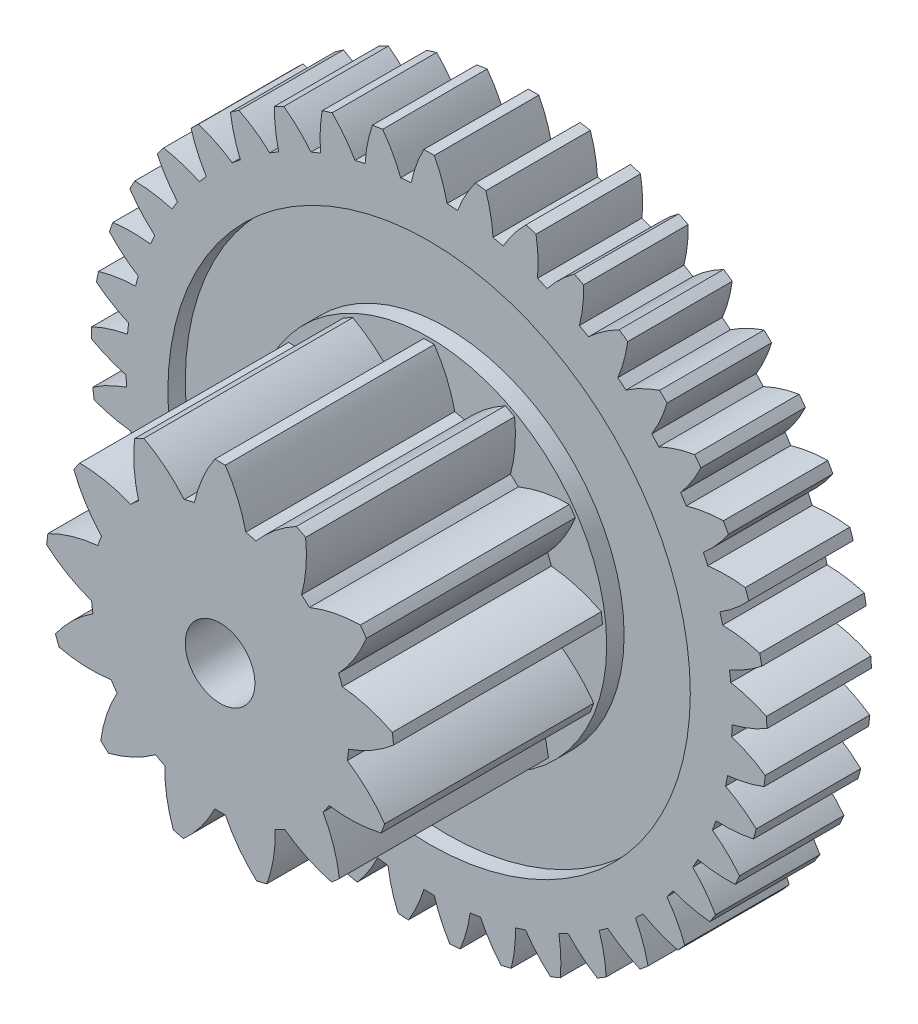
from build123d import *

# Parameters (mm, degrees)
ESQUISSE1_R                  = 9.7
BASE_EXTRUSION_DEPTH         = 3
ESQUISSE2_R                  = 5
BOSS_EXTRU_1_DEPTH           = 6
ENL_V_START                  = -6
ENL_V_MAT_EXTRU_1_DEPTH      = 6
R_P_TITION_CIRCULAIRE1_COUNT = 13
ENL_V_MAT_EXTRU_2_DEPTH      = 15.972641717
R_P_TITION_CIRCULAIRE2_COUNT = 41
ESQUISSE5_R                  = 1
ENL_V_MAT_EXTRU_3_DEPTH      = 17.405209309
ESQUISSE6_R                  = 2.25
ESQUISSE6_R_2                = 1
EXTRUSION1_DEPTH             = 0.5
ESQUISSE7_R                  = 7.5
ESQUISSE7_R_2                = 5.1
ENL_V_MAT_EXTRU_4_DEPTH      = 0.5


with BuildPart() as part:
    # Esquisse1 → Base-Extrusion (new body)
    with BuildSketch(Plane.XY):
        Circle(ESQUISSE1_R)
    extrude(amount=BASE_EXTRUSION_DEPTH)

    # Esquisse2 → Boss.-Extru.1 (add)
    with BuildSketch(Plane.XY.offset(3)):
        Circle(ESQUISSE2_R)
    extrude(amount=BOSS_EXTRU_1_DEPTH)

    # Esquisse3 → Enl_v. mat.-Extru.1 (cut)
    with BuildSketch(Plane.XY.offset(9).offset(ENL_V_START)):
        with BuildLine():
            Line((0.885467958, 3.592484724), (1.326867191, 5.383311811))
            Line((1.326867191, 5.383311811), (-1.326867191, 5.383311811))
            Line((-1.326867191, 5.383311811), (-0.885467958, 3.592484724))
            ThreePointArc((-0.885467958, 3.592484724), (-0.811650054, 3.609878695), (-0.737491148, 3.625756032))
            ThreePointArc((-0.737491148, 3.625756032), (-0.508302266, 4.339396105), (-0.15, 4.997749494))
            ThreePointArc((-0.15, 4.997749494), (0, 5), (0.15, 4.997749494))
            ThreePointArc((0.15, 4.997749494), (0.508302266, 4.339396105), (0.737491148, 3.625756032))
            ThreePointArc((0.737491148, 3.625756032), (0.811650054, 3.609878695), (0.885467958, 3.592484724))
        make_face()
    enl_v_mat_extru_1 = extrude(amount=ENL_V_MAT_EXTRU_1_DEPTH, mode=Mode.SUBTRACT)

    # R_p_tition circulaire1: Enl_v. mat.-Extru.1 ×13 about axis
    r_p_tition_circulaire1_axis = Axis((0, 0, 0), (0, 0, 1))
    for i in range(1, R_P_TITION_CIRCULAIRE1_COUNT):
        add(enl_v_mat_extru_1.rotate(r_p_tition_circulaire1_axis, i * 360 / R_P_TITION_CIRCULAIRE1_COUNT), mode=Mode.SUBTRACT)

    # Esquisse4 → Enl_v. mat.-Extru.2 (cut, through all)
    with BuildSketch(Plane.XY.offset(3)):
        with BuildLine():
            Line((0.6659785, 8.67447247), (1.057291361, 13.771382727))
            Line((1.057291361, 13.771382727), (-1.057291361, 13.771382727))
            Line((-1.057291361, 13.771382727), (-0.6659785, 8.67447247))
            ThreePointArc((-0.6659785, 8.67447247), (-0.591171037, 8.67989152), (-0.516319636, 8.684665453))
            ThreePointArc((-0.516319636, 8.684665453), (-0.367491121, 9.204153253), (-0.15, 9.698840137))
            ThreePointArc((-0.15, 9.698840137), (0, 9.7), (0.15, 9.698840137))
            ThreePointArc((0.15, 9.698840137), (0.367491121, 9.204153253), (0.516319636, 8.684665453))
            ThreePointArc((0.516319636, 8.684665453), (0.591171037, 8.67989152), (0.6659785, 8.67447247))
        make_face()
    enl_v_mat_extru_2 = extrude(amount=-ENL_V_MAT_EXTRU_2_DEPTH, mode=Mode.SUBTRACT)

    # R_p_tition circulaire2: Enl_v. mat.-Extru.2 ×41 about axis
    r_p_tition_circulaire2_axis = Axis((0, 0, 0), (0, 0, 1))
    for i in range(1, R_P_TITION_CIRCULAIRE2_COUNT):
        add(enl_v_mat_extru_2.rotate(r_p_tition_circulaire2_axis, i * 360 / R_P_TITION_CIRCULAIRE2_COUNT), mode=Mode.SUBTRACT)

    # Esquisse5 → Enl_v. mat.-Extru.3 (cut, through all)
    with BuildSketch(Plane.XY.offset(9)):
        Circle(ESQUISSE5_R)
    extrude(amount=-ENL_V_MAT_EXTRU_3_DEPTH, mode=Mode.SUBTRACT)

    # Esquisse6 → Extrusion1 (add)
    with BuildSketch(Plane(origin=(0, 0, 0), x_dir=(-1, 0, 0), z_dir=(0, 0, -1))):
        with Locations(Location((0, 0, 0), (0, 0, 180))):
            Circle(ESQUISSE6_R)
        with Locations(Location((0, 0, 0), (0, 0, 180))):
            Circle(ESQUISSE6_R_2, mode=Mode.SUBTRACT)
    extrude(amount=EXTRUSION1_DEPTH)

    # Esquisse7 → Enl_v. mat.-Extru.4 (cut)
    with BuildSketch(Plane.XY.offset(3)):
        Circle(ESQUISSE7_R)
        Circle(ESQUISSE7_R_2, mode=Mode.SUBTRACT)
    extrude(amount=-ENL_V_MAT_EXTRU_4_DEPTH, mode=Mode.SUBTRACT)


solid = part.part
